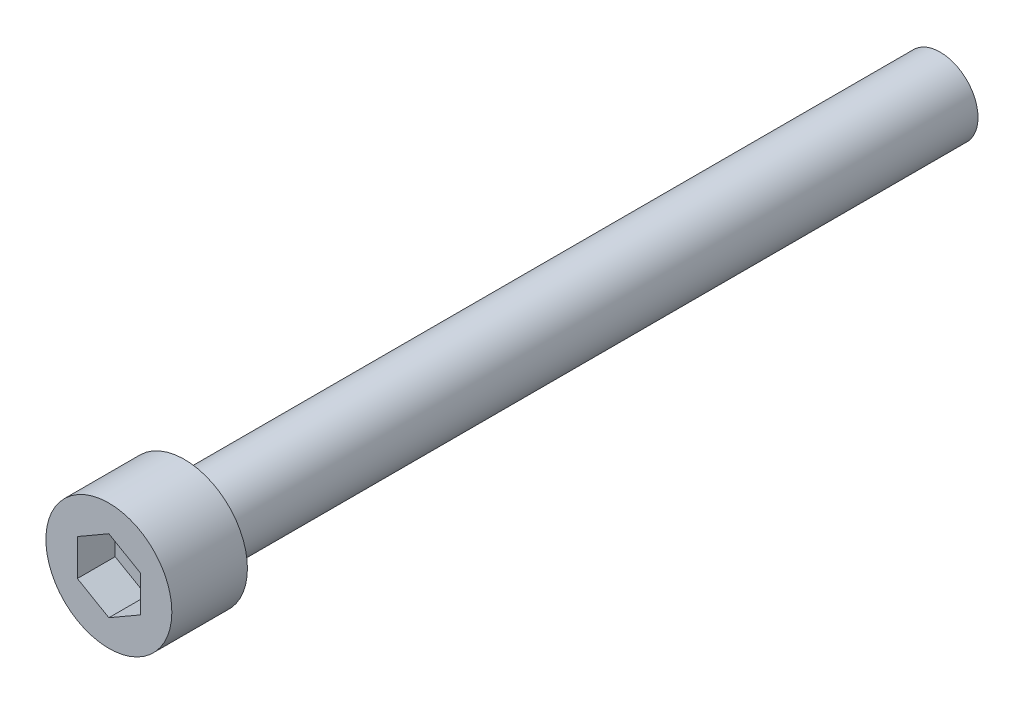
ISO-10303-21;
HEADER;
FILE_DESCRIPTION(('STEP AP214'),'2;1');
FILE_NAME('part.step','',(''),(''),'','','');
FILE_SCHEMA(('AUTOMOTIVE_DESIGN { 1 0 10303 214 1 1 1 1 }'));
ENDSEC;
DATA;
#1=APPLICATION_CONTEXT('core data for automotive mechanical design processes');
#2=APPLICATION_PROTOCOL_DEFINITION('international standard','automotive_design',2000,#1);
#3=PRODUCT_CONTEXT('',#1,'mechanical');
#4=PRODUCT('Part','Part','',(#3));
#5=PRODUCT_RELATED_PRODUCT_CATEGORY('part','',(#4));
#6=PRODUCT_DEFINITION_FORMATION('','',#4);
#7=PRODUCT_DEFINITION_CONTEXT('part definition',#1,'design');
#8=PRODUCT_DEFINITION('design','',#6,#7);
#9=PRODUCT_DEFINITION_SHAPE('','',#8);
#10=(LENGTH_UNIT() NAMED_UNIT(*) SI_UNIT(.MILLI.,.METRE.));
#11=(NAMED_UNIT(*) PLANE_ANGLE_UNIT() SI_UNIT($,.RADIAN.));
#12=(NAMED_UNIT(*) SI_UNIT($,.STERADIAN.) SOLID_ANGLE_UNIT());
#13=UNCERTAINTY_MEASURE_WITH_UNIT(LENGTH_MEASURE(1.E-05),#10,'distance_accuracy_value','');
#14=(GEOMETRIC_REPRESENTATION_CONTEXT(3) GLOBAL_UNCERTAINTY_ASSIGNED_CONTEXT((#13)) GLOBAL_UNIT_ASSIGNED_CONTEXT((#10,
#11,#12)) REPRESENTATION_CONTEXT('',''));
#15=CARTESIAN_POINT('',(0.,0.,0.));
#16=DIRECTION('',(0.,0.,1.));
#17=DIRECTION('',(1.,0.,0.));
#18=AXIS2_PLACEMENT_3D('',#15,#16,#17);
#19=CARTESIAN_POINT('',(0.,2.88675134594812,3.));
#20=DIRECTION('',(-0.5,-0.86602540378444,0.));
#21=DIRECTION('',(0.86602540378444,-0.5,0.));
#22=AXIS2_PLACEMENT_3D('',#19,#20,#21);
#23=PLANE('',#22);
#24=DIRECTION('',(0.,0.,1.));
#25=VECTOR('',#24,1.);
#26=CARTESIAN_POINT('',(2.5,1.44337567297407,3.));
#27=LINE('',#26,#25);
#28=CARTESIAN_POINT('',(2.5,1.44337567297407,3.));
#29=VERTEX_POINT('',#28);
#30=CARTESIAN_POINT('',(2.5,1.44337567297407,6.));
#31=VERTEX_POINT('',#30);
#32=EDGE_CURVE('E66',#29,#31,#27,.T.);
#33=ORIENTED_EDGE('',*,*,#32,.T.);
#34=DIRECTION('',(0.86602540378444,-0.5,0.));
#35=VECTOR('',#34,1.);
#36=CARTESIAN_POINT('',(0.,2.88675134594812,6.));
#37=LINE('',#36,#35);
#38=CARTESIAN_POINT('',(0.,2.88675134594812,6.));
#39=VERTEX_POINT('',#38);
#40=EDGE_CURVE('E32',#39,#31,#37,.T.);
#41=ORIENTED_EDGE('',*,*,#40,.F.);
#42=DIRECTION('',(0.,0.,1.));
#43=VECTOR('',#42,1.);
#44=CARTESIAN_POINT('',(0.,2.88675134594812,3.));
#45=LINE('',#44,#43);
#46=CARTESIAN_POINT('',(0.,2.88675134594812,3.));
#47=VERTEX_POINT('',#46);
#48=EDGE_CURVE('E36',#47,#39,#45,.T.);
#49=ORIENTED_EDGE('',*,*,#48,.F.);
#50=DIRECTION('',(0.86602540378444,-0.5,0.));
#51=VECTOR('',#50,1.);
#52=CARTESIAN_POINT('',(0.,2.88675134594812,3.));
#53=LINE('',#52,#51);
#54=EDGE_CURVE('E68',#47,#29,#53,.T.);
#55=ORIENTED_EDGE('',*,*,#54,.T.);
#56=EDGE_LOOP('',(#33,#41,#49,#55));
#57=FACE_BOUND('',#56,.T.);
#58=ADVANCED_FACE('F17',(#57),#23,.T.);
#59=CARTESIAN_POINT('',(2.5,-1.44337567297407,3.));
#60=DIRECTION('',(1.,0.,0.));
#61=DIRECTION('',(0.,1.,0.));
#62=AXIS2_PLACEMENT_3D('',#59,#60,#61);
#63=PLANE('',#62);
#64=DIRECTION('',(0.,0.,1.));
#65=VECTOR('',#64,1.);
#66=CARTESIAN_POINT('',(2.5,-1.44337567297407,3.));
#67=LINE('',#66,#65);
#68=CARTESIAN_POINT('',(2.5,-1.44337567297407,3.));
#69=VERTEX_POINT('',#68);
#70=CARTESIAN_POINT('',(2.5,-1.44337567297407,6.));
#71=VERTEX_POINT('',#70);
#72=EDGE_CURVE('E73',#69,#71,#67,.T.);
#73=ORIENTED_EDGE('',*,*,#72,.T.);
#74=DIRECTION('',(0.,1.,0.));
#75=VECTOR('',#74,1.);
#76=CARTESIAN_POINT('',(2.5,-1.44337567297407,6.));
#77=LINE('',#76,#75);
#78=EDGE_CURVE('E76',#71,#31,#77,.T.);
#79=ORIENTED_EDGE('',*,*,#78,.T.);
#80=ORIENTED_EDGE('',*,*,#32,.F.);
#81=DIRECTION('',(0.,1.,0.));
#82=VECTOR('',#81,1.);
#83=CARTESIAN_POINT('',(2.5,-1.44337567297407,3.));
#84=LINE('',#83,#82);
#85=EDGE_CURVE('E106',#69,#29,#84,.T.);
#86=ORIENTED_EDGE('',*,*,#85,.F.);
#87=EDGE_LOOP('',(#73,#79,#80,#86));
#88=FACE_BOUND('',#87,.T.);
#89=ADVANCED_FACE('F77',(#88),#63,.F.);
#90=CARTESIAN_POINT('',(0.,-2.88675134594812,3.));
#91=DIRECTION('',(0.5,-0.86602540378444,0.));
#92=DIRECTION('',(0.86602540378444,0.5,0.));
#93=AXIS2_PLACEMENT_3D('',#90,#91,#92);
#94=PLANE('',#93);
#95=DIRECTION('',(0.,0.,1.));
#96=VECTOR('',#95,1.);
#97=CARTESIAN_POINT('',(0.,-2.88675134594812,3.));
#98=LINE('',#97,#96);
#99=CARTESIAN_POINT('',(0.,-2.88675134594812,3.));
#100=VERTEX_POINT('',#99);
#101=CARTESIAN_POINT('',(0.,-2.88675134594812,6.));
#102=VERTEX_POINT('',#101);
#103=EDGE_CURVE('E114',#100,#102,#98,.T.);
#104=ORIENTED_EDGE('',*,*,#103,.T.);
#105=DIRECTION('',(0.86602540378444,0.5,0.));
#106=VECTOR('',#105,1.);
#107=CARTESIAN_POINT('',(0.,-2.88675134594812,6.));
#108=LINE('',#107,#106);
#109=EDGE_CURVE('E81',#102,#71,#108,.T.);
#110=ORIENTED_EDGE('',*,*,#109,.T.);
#111=ORIENTED_EDGE('',*,*,#72,.F.);
#112=DIRECTION('',(0.86602540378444,0.5,0.));
#113=VECTOR('',#112,1.);
#114=CARTESIAN_POINT('',(0.,-2.88675134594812,3.));
#115=LINE('',#114,#113);
#116=EDGE_CURVE('E103',#100,#69,#115,.T.);
#117=ORIENTED_EDGE('',*,*,#116,.F.);
#118=EDGE_LOOP('',(#104,#110,#111,#117));
#119=FACE_BOUND('',#118,.T.);
#120=ADVANCED_FACE('F144',(#119),#94,.F.);
#121=CARTESIAN_POINT('',(0.,-2.88675134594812,3.));
#122=DIRECTION('',(0.5,0.86602540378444,0.));
#123=DIRECTION('',(-0.86602540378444,0.5,0.));
#124=AXIS2_PLACEMENT_3D('',#121,#122,#123);
#125=PLANE('',#124);
#126=DIRECTION('',(0.,0.,1.));
#127=VECTOR('',#126,1.);
#128=CARTESIAN_POINT('',(-2.5,-1.44337567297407,3.));
#129=LINE('',#128,#127);
#130=CARTESIAN_POINT('',(-2.5,-1.44337567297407,3.));
#131=VERTEX_POINT('',#130);
#132=CARTESIAN_POINT('',(-2.5,-1.44337567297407,6.));
#133=VERTEX_POINT('',#132);
#134=EDGE_CURVE('E112',#131,#133,#129,.T.);
#135=ORIENTED_EDGE('',*,*,#134,.T.);
#136=DIRECTION('',(-0.86602540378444,0.5,0.));
#137=VECTOR('',#136,1.);
#138=CARTESIAN_POINT('',(0.,-2.88675134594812,6.));
#139=LINE('',#138,#137);
#140=EDGE_CURVE('E170',#102,#133,#139,.T.);
#141=ORIENTED_EDGE('',*,*,#140,.F.);
#142=ORIENTED_EDGE('',*,*,#103,.F.);
#143=DIRECTION('',(-0.86602540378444,0.5,0.));
#144=VECTOR('',#143,1.);
#145=CARTESIAN_POINT('',(0.,-2.88675134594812,3.));
#146=LINE('',#145,#144);
#147=EDGE_CURVE('E100',#100,#131,#146,.T.);
#148=ORIENTED_EDGE('',*,*,#147,.T.);
#149=EDGE_LOOP('',(#135,#141,#142,#148));
#150=FACE_BOUND('',#149,.T.);
#151=ADVANCED_FACE('F156',(#150),#125,.T.);
#152=CARTESIAN_POINT('',(-2.5,1.44337567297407,3.));
#153=DIRECTION('',(-1.,0.,0.));
#154=DIRECTION('',(0.,-1.,0.));
#155=AXIS2_PLACEMENT_3D('',#152,#153,#154);
#156=PLANE('',#155);
#157=DIRECTION('',(0.,0.,1.));
#158=VECTOR('',#157,1.);
#159=CARTESIAN_POINT('',(-2.5,1.44337567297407,3.));
#160=LINE('',#159,#158);
#161=CARTESIAN_POINT('',(-2.5,1.44337567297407,3.));
#162=VERTEX_POINT('',#161);
#163=CARTESIAN_POINT('',(-2.5,1.44337567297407,6.));
#164=VERTEX_POINT('',#163);
#165=EDGE_CURVE('E110',#162,#164,#160,.T.);
#166=ORIENTED_EDGE('',*,*,#165,.T.);
#167=DIRECTION('',(0.,-1.,0.));
#168=VECTOR('',#167,1.);
#169=CARTESIAN_POINT('',(-2.5,1.44337567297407,6.));
#170=LINE('',#169,#168);
#171=EDGE_CURVE('E172',#164,#133,#170,.T.);
#172=ORIENTED_EDGE('',*,*,#171,.T.);
#173=ORIENTED_EDGE('',*,*,#134,.F.);
#174=DIRECTION('',(0.,-1.,0.));
#175=VECTOR('',#174,1.);
#176=CARTESIAN_POINT('',(-2.5,1.44337567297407,3.));
#177=LINE('',#176,#175);
#178=EDGE_CURVE('E97',#162,#131,#177,.T.);
#179=ORIENTED_EDGE('',*,*,#178,.F.);
#180=EDGE_LOOP('',(#166,#172,#173,#179));
#181=FACE_BOUND('',#180,.T.);
#182=ADVANCED_FACE('F152',(#181),#156,.F.);
#183=CARTESIAN_POINT('',(0.,2.88675134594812,3.));
#184=DIRECTION('',(-0.5,0.86602540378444,0.));
#185=DIRECTION('',(-0.86602540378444,-0.5,0.));
#186=AXIS2_PLACEMENT_3D('',#183,#184,#185);
#187=PLANE('',#186);
#188=DIRECTION('',(-0.86602540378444,-0.5,0.));
#189=VECTOR('',#188,1.);
#190=CARTESIAN_POINT('',(0.,2.88675134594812,3.));
#191=LINE('',#190,#189);
#192=EDGE_CURVE('E94',#47,#162,#191,.T.);
#193=ORIENTED_EDGE('',*,*,#192,.F.);
#194=ORIENTED_EDGE('',*,*,#48,.T.);
#195=DIRECTION('',(-0.86602540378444,-0.5,0.));
#196=VECTOR('',#195,1.);
#197=CARTESIAN_POINT('',(0.,2.88675134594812,6.));
#198=LINE('',#197,#196);
#199=EDGE_CURVE('E87',#39,#164,#198,.T.);
#200=ORIENTED_EDGE('',*,*,#199,.T.);
#201=ORIENTED_EDGE('',*,*,#165,.F.);
#202=EDGE_LOOP('',(#193,#194,#200,#201));
#203=FACE_BOUND('',#202,.T.);
#204=ADVANCED_FACE('F149',(#203),#187,.F.);
#205=CARTESIAN_POINT('',(2.5,1.44337567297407,3.));
#206=DIRECTION('',(0.,0.,1.));
#207=DIRECTION('',(1.,0.,0.));
#208=AXIS2_PLACEMENT_3D('',#205,#206,#207);
#209=PLANE('',#208);
#210=ORIENTED_EDGE('',*,*,#54,.F.);
#211=ORIENTED_EDGE('',*,*,#192,.T.);
#212=ORIENTED_EDGE('',*,*,#178,.T.);
#213=ORIENTED_EDGE('',*,*,#147,.F.);
#214=ORIENTED_EDGE('',*,*,#116,.T.);
#215=ORIENTED_EDGE('',*,*,#85,.T.);
#216=EDGE_LOOP('',(#210,#211,#212,#213,#214,#215));
#217=FACE_BOUND('',#216,.T.);
#218=ADVANCED_FACE('F147',(#217),#209,.T.);
#219=CARTESIAN_POINT('',(0.,0.,6.));
#220=DIRECTION('',(0.,0.,1.));
#221=DIRECTION('',(1.,0.,0.));
#222=AXIS2_PLACEMENT_3D('',#219,#220,#221);
#223=PLANE('',#222);
#224=CARTESIAN_POINT('',(0.,0.,6.));
#225=DIRECTION('',(0.,0.,1.));
#226=DIRECTION('',(1.,0.,0.));
#227=AXIS2_PLACEMENT_3D('',#224,#225,#226);
#228=CIRCLE('',#227,5.);
#229=CARTESIAN_POINT('',(5.,0.,6.));
#230=VERTEX_POINT('',#229);
#231=EDGE_CURVE('E11',#230,#230,#228,.T.);
#232=ORIENTED_EDGE('',*,*,#231,.T.);
#233=EDGE_LOOP('',(#232));
#234=FACE_BOUND('',#233,.T.);
#235=ORIENTED_EDGE('',*,*,#199,.F.);
#236=ORIENTED_EDGE('',*,*,#40,.T.);
#237=ORIENTED_EDGE('',*,*,#78,.F.);
#238=ORIENTED_EDGE('',*,*,#109,.F.);
#239=ORIENTED_EDGE('',*,*,#140,.T.);
#240=ORIENTED_EDGE('',*,*,#171,.F.);
#241=EDGE_LOOP('',(#235,#236,#237,#238,#239,#240));
#242=FACE_BOUND('',#241,.T.);
#243=ADVANCED_FACE('F84',(#234,#242),#223,.T.);
#244=CARTESIAN_POINT('',(0.,0.,10.));
#245=DIRECTION('',(0.,0.,1.));
#246=DIRECTION('',(1.,0.,0.));
#247=AXIS2_PLACEMENT_3D('',#244,#245,#246);
#248=CYLINDRICAL_SURFACE('',#247,5.);
#249=CARTESIAN_POINT('',(0.,0.,0.));
#250=DIRECTION('',(0.,0.,1.));
#251=DIRECTION('',(1.,0.,0.));
#252=AXIS2_PLACEMENT_3D('',#249,#250,#251);
#253=CIRCLE('',#252,5.);
#254=CARTESIAN_POINT('',(5.,0.,0.));
#255=VERTEX_POINT('',#254);
#256=EDGE_CURVE('E25',#255,#255,#253,.T.);
#257=ORIENTED_EDGE('',*,*,#256,.T.);
#258=EDGE_LOOP('',(#257));
#259=FACE_BOUND('',#258,.T.);
#260=ORIENTED_EDGE('',*,*,#231,.F.);
#261=EDGE_LOOP('',(#260));
#262=FACE_BOUND('',#261,.T.);
#263=ADVANCED_FACE('F121',(#259,#262),#248,.T.);
#264=CARTESIAN_POINT('',(5.,0.,0.));
#265=DIRECTION('',(0.,0.,-1.));
#266=DIRECTION('',(-1.,0.,0.));
#267=AXIS2_PLACEMENT_3D('',#264,#265,#266);
#268=PLANE('',#267);
#269=CARTESIAN_POINT('',(0.,0.,0.));
#270=DIRECTION('',(0.,0.,1.));
#271=DIRECTION('',(1.,0.,0.));
#272=AXIS2_PLACEMENT_3D('',#269,#270,#271);
#273=CIRCLE('',#272,3.);
#274=CARTESIAN_POINT('',(3.,0.,0.));
#275=VERTEX_POINT('',#274);
#276=EDGE_CURVE('E72',#275,#275,#273,.T.);
#277=ORIENTED_EDGE('',*,*,#276,.T.);
#278=EDGE_LOOP('',(#277));
#279=FACE_BOUND('',#278,.T.);
#280=ORIENTED_EDGE('',*,*,#256,.F.);
#281=EDGE_LOOP('',(#280));
#282=FACE_BOUND('',#281,.T.);
#283=ADVANCED_FACE('F124',(#279,#282),#268,.T.);
#284=CARTESIAN_POINT('',(0.,0.,10.));
#285=DIRECTION('',(0.,0.,1.));
#286=DIRECTION('',(1.,0.,0.));
#287=AXIS2_PLACEMENT_3D('',#284,#285,#286);
#288=CYLINDRICAL_SURFACE('',#287,3.);
#289=ORIENTED_EDGE('',*,*,#276,.F.);
#290=EDGE_LOOP('',(#289));
#291=FACE_BOUND('',#290,.T.);
#292=CARTESIAN_POINT('',(0.,0.,-60.));
#293=DIRECTION('',(0.,0.,-1.));
#294=DIRECTION('',(-1.,0.,0.));
#295=AXIS2_PLACEMENT_3D('',#292,#293,#294);
#296=CIRCLE('',#295,3.);
#297=CARTESIAN_POINT('',(-3.,0.,-60.));
#298=VERTEX_POINT('',#297);
#299=EDGE_CURVE('E88',#298,#298,#296,.T.);
#300=ORIENTED_EDGE('',*,*,#299,.F.);
#301=EDGE_LOOP('',(#300));
#302=FACE_BOUND('',#301,.T.);
#303=ADVANCED_FACE('F19',(#291,#302),#288,.T.);
#304=CARTESIAN_POINT('',(0.,0.,-60.));
#305=DIRECTION('',(0.,0.,-1.));
#306=DIRECTION('',(-1.,0.,0.));
#307=AXIS2_PLACEMENT_3D('',#304,#305,#306);
#308=PLANE('',#307);
#309=ORIENTED_EDGE('',*,*,#299,.T.);
#310=EDGE_LOOP('',(#309));
#311=FACE_BOUND('',#310,.T.);
#312=ADVANCED_FACE('F134',(#311),#308,.T.);
#313=CLOSED_SHELL('',(#58,#89,#120,#151,#182,#204,#218,#243,#263,#283,#303,#312));
#314=MANIFOLD_SOLID_BREP('B1',#313);
#315=ADVANCED_BREP_SHAPE_REPRESENTATION('',(#18,#314),#14);
#316=SHAPE_DEFINITION_REPRESENTATION(#9,#315);
ENDSEC;
END-ISO-10303-21;
